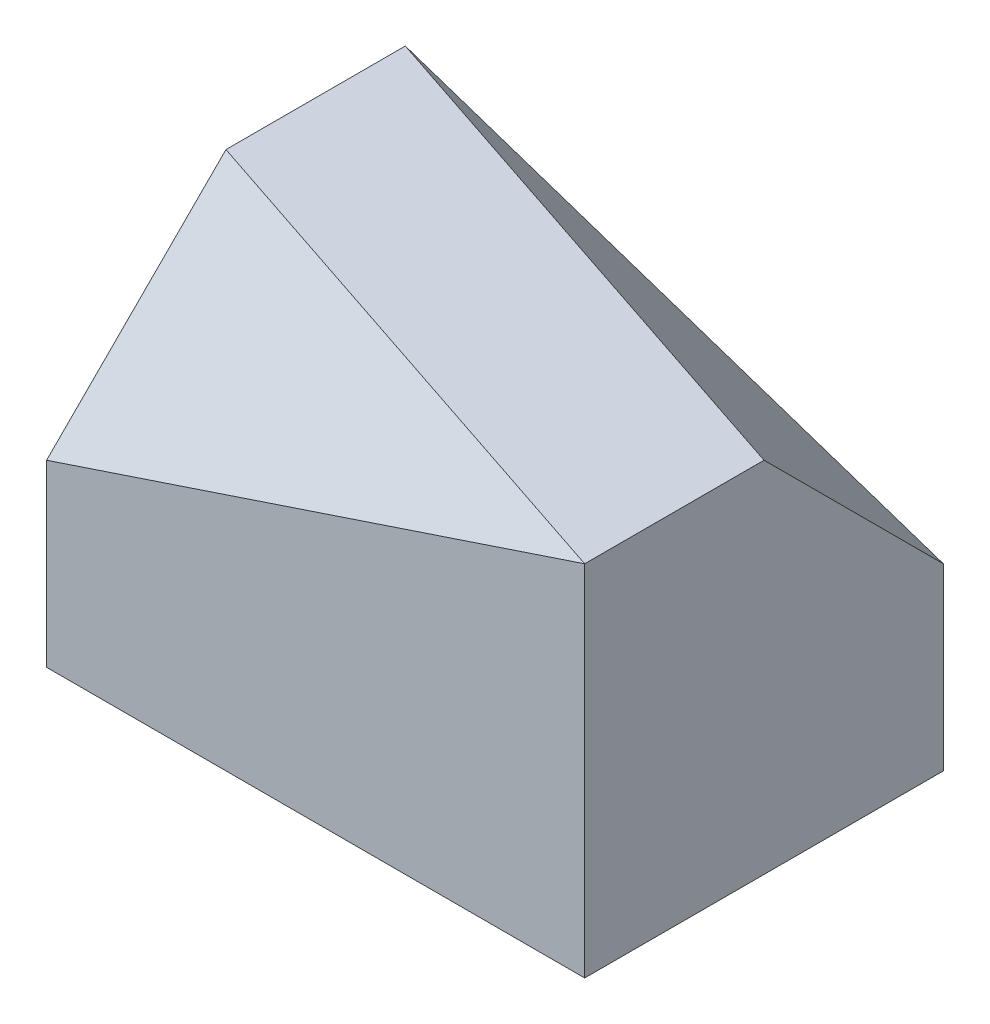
ISO-10303-21;
HEADER;
FILE_DESCRIPTION(('STEP AP214'),'2;1');
FILE_NAME('part.step','',(''),(''),'','','');
FILE_SCHEMA(('AUTOMOTIVE_DESIGN { 1 0 10303 214 1 1 1 1 }'));
ENDSEC;
DATA;
#1=APPLICATION_CONTEXT('core data for automotive mechanical design processes');
#2=APPLICATION_PROTOCOL_DEFINITION('international standard','automotive_design',2000,#1);
#3=PRODUCT_CONTEXT('',#1,'mechanical');
#4=PRODUCT('Part','Part','',(#3));
#5=PRODUCT_RELATED_PRODUCT_CATEGORY('part','',(#4));
#6=PRODUCT_DEFINITION_FORMATION('','',#4);
#7=PRODUCT_DEFINITION_CONTEXT('part definition',#1,'design');
#8=PRODUCT_DEFINITION('design','',#6,#7);
#9=PRODUCT_DEFINITION_SHAPE('','',#8);
#10=(LENGTH_UNIT() NAMED_UNIT(*) SI_UNIT(.MILLI.,.METRE.));
#11=(NAMED_UNIT(*) PLANE_ANGLE_UNIT() SI_UNIT($,.RADIAN.));
#12=(NAMED_UNIT(*) SI_UNIT($,.STERADIAN.) SOLID_ANGLE_UNIT());
#13=UNCERTAINTY_MEASURE_WITH_UNIT(LENGTH_MEASURE(1.E-05),#10,'distance_accuracy_value','');
#14=(GEOMETRIC_REPRESENTATION_CONTEXT(3) GLOBAL_UNCERTAINTY_ASSIGNED_CONTEXT((#13)) GLOBAL_UNIT_ASSIGNED_CONTEXT((#10,
#11,#12)) REPRESENTATION_CONTEXT('',''));
#15=CARTESIAN_POINT('',(0.,0.,0.));
#16=DIRECTION('',(0.,0.,1.));
#17=DIRECTION('',(1.,0.,0.));
#18=AXIS2_PLACEMENT_3D('',#15,#16,#17);
#19=CARTESIAN_POINT('',(0.,40.,-40.));
#20=DIRECTION('',(0.,-1.,0.));
#21=DIRECTION('',(0.,0.,-1.));
#22=AXIS2_PLACEMENT_3D('',#19,#20,#21);
#23=PLANE('',#22);
#24=DIRECTION('',(0.948683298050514,0.,0.316227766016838));
#25=VECTOR('',#24,1.);
#26=CARTESIAN_POINT('',(0.,40.,-40.));
#27=LINE('',#26,#25);
#28=CARTESIAN_POINT('',(0.,40.,-40.));
#29=VERTEX_POINT('',#28);
#30=CARTESIAN_POINT('',(60.,40.,-20.));
#31=VERTEX_POINT('',#30);
#32=EDGE_CURVE('E94',#29,#31,#27,.T.);
#33=ORIENTED_EDGE('',*,*,#32,.F.);
#34=DIRECTION('',(0.,0.,1.));
#35=VECTOR('',#34,1.);
#36=CARTESIAN_POINT('',(0.,40.,0.));
#37=LINE('',#36,#35);
#38=CARTESIAN_POINT('',(0.,40.,-20.));
#39=VERTEX_POINT('',#38);
#40=EDGE_CURVE('E77',#29,#39,#37,.T.);
#41=ORIENTED_EDGE('',*,*,#40,.T.);
#42=DIRECTION('',(0.948683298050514,0.,0.316227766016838));
#43=VECTOR('',#42,1.);
#44=CARTESIAN_POINT('',(-6.,40.,-22.));
#45=LINE('',#44,#43);
#46=CARTESIAN_POINT('',(60.,40.,0.));
#47=VERTEX_POINT('',#46);
#48=EDGE_CURVE('E96',#39,#47,#45,.T.);
#49=ORIENTED_EDGE('',*,*,#48,.T.);
#50=DIRECTION('',(0.,0.,-1.));
#51=VECTOR('',#50,1.);
#52=CARTESIAN_POINT('',(60.,40.,0.));
#53=LINE('',#52,#51);
#54=EDGE_CURVE('E86',#47,#31,#53,.T.);
#55=ORIENTED_EDGE('',*,*,#54,.T.);
#56=EDGE_LOOP('',(#33,#41,#49,#55));
#57=FACE_BOUND('',#56,.T.);
#58=ADVANCED_FACE('F30',(#57),#23,.F.);
#59=CARTESIAN_POINT('',(0.,40.,0.));
#60=DIRECTION('',(0.,0.,-1.));
#61=DIRECTION('',(-1.,0.,0.));
#62=AXIS2_PLACEMENT_3D('',#59,#60,#61);
#63=PLANE('',#62);
#64=DIRECTION('',(0.,-1.,0.));
#65=VECTOR('',#64,1.);
#66=CARTESIAN_POINT('',(60.,40.,0.));
#67=LINE('',#66,#65);
#68=CARTESIAN_POINT('',(60.,0.,0.));
#69=VERTEX_POINT('',#68);
#70=EDGE_CURVE('E107',#47,#69,#67,.T.);
#71=ORIENTED_EDGE('',*,*,#70,.F.);
#72=DIRECTION('',(-0.948683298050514,-0.316227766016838,0.));
#73=VECTOR('',#72,1.);
#74=CARTESIAN_POINT('',(6.,22.,0.));
#75=LINE('',#74,#73);
#76=CARTESIAN_POINT('',(0.,20.,0.));
#77=VERTEX_POINT('',#76);
#78=EDGE_CURVE('E101',#47,#77,#75,.T.);
#79=ORIENTED_EDGE('',*,*,#78,.T.);
#80=DIRECTION('',(0.,-1.,0.));
#81=VECTOR('',#80,1.);
#82=CARTESIAN_POINT('',(0.,40.,0.));
#83=LINE('',#82,#81);
#84=CARTESIAN_POINT('',(0.,0.,0.));
#85=VERTEX_POINT('',#84);
#86=EDGE_CURVE('E105',#77,#85,#83,.T.);
#87=ORIENTED_EDGE('',*,*,#86,.T.);
#88=DIRECTION('',(1.,0.,0.));
#89=VECTOR('',#88,1.);
#90=CARTESIAN_POINT('',(0.,0.,0.));
#91=LINE('',#90,#89);
#92=EDGE_CURVE('E115',#85,#69,#91,.T.);
#93=ORIENTED_EDGE('',*,*,#92,.T.);
#94=EDGE_LOOP('',(#71,#79,#87,#93));
#95=FACE_BOUND('',#94,.T.);
#96=ADVANCED_FACE('F125',(#95),#63,.F.);
#97=CARTESIAN_POINT('',(0.,40.,0.));
#98=DIRECTION('',(1.,0.,0.));
#99=DIRECTION('',(0.,0.,-1.));
#100=AXIS2_PLACEMENT_3D('',#97,#98,#99);
#101=PLANE('',#100);
#102=ORIENTED_EDGE('',*,*,#86,.F.);
#103=DIRECTION('',(0.,0.707106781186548,-0.707106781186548));
#104=VECTOR('',#103,1.);
#105=CARTESIAN_POINT('',(0.,30.,-10.));
#106=LINE('',#105,#104);
#107=EDGE_CURVE('E82',#77,#39,#106,.T.);
#108=ORIENTED_EDGE('',*,*,#107,.T.);
#109=ORIENTED_EDGE('',*,*,#40,.F.);
#110=DIRECTION('',(0.,-1.,0.));
#111=VECTOR('',#110,1.);
#112=CARTESIAN_POINT('',(0.,40.,-40.));
#113=LINE('',#112,#111);
#114=CARTESIAN_POINT('',(0.,0.,-40.));
#115=VERTEX_POINT('',#114);
#116=EDGE_CURVE('E80',#29,#115,#113,.T.);
#117=ORIENTED_EDGE('',*,*,#116,.T.);
#118=DIRECTION('',(0.,0.,1.));
#119=VECTOR('',#118,1.);
#120=CARTESIAN_POINT('',(0.,0.,0.));
#121=LINE('',#120,#119);
#122=EDGE_CURVE('E117',#115,#85,#121,.T.);
#123=ORIENTED_EDGE('',*,*,#122,.T.);
#124=EDGE_LOOP('',(#102,#108,#109,#117,#123));
#125=FACE_BOUND('',#124,.T.);
#126=ADVANCED_FACE('F32',(#125),#101,.F.);
#127=CARTESIAN_POINT('',(60.,40.,0.));
#128=DIRECTION('',(-1.,0.,0.));
#129=DIRECTION('',(0.,0.,1.));
#130=AXIS2_PLACEMENT_3D('',#127,#128,#129);
#131=PLANE('',#130);
#132=DIRECTION('',(0.,-0.707106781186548,-0.707106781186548));
#133=VECTOR('',#132,1.);
#134=CARTESIAN_POINT('',(60.,50.,-10.));
#135=LINE('',#134,#133);
#136=CARTESIAN_POINT('',(60.,20.,-40.));
#137=VERTEX_POINT('',#136);
#138=EDGE_CURVE('E38',#31,#137,#135,.T.);
#139=ORIENTED_EDGE('',*,*,#138,.F.);
#140=ORIENTED_EDGE('',*,*,#54,.F.);
#141=ORIENTED_EDGE('',*,*,#70,.T.);
#142=DIRECTION('',(0.,0.,-1.));
#143=VECTOR('',#142,1.);
#144=CARTESIAN_POINT('',(60.,0.,0.));
#145=LINE('',#144,#143);
#146=CARTESIAN_POINT('',(60.,0.,-40.));
#147=VERTEX_POINT('',#146);
#148=EDGE_CURVE('E112',#69,#147,#145,.T.);
#149=ORIENTED_EDGE('',*,*,#148,.T.);
#150=DIRECTION('',(0.,-1.,0.));
#151=VECTOR('',#150,1.);
#152=CARTESIAN_POINT('',(60.,40.,-40.));
#153=LINE('',#152,#151);
#154=EDGE_CURVE('E91',#137,#147,#153,.T.);
#155=ORIENTED_EDGE('',*,*,#154,.F.);
#156=EDGE_LOOP('',(#139,#140,#141,#149,#155));
#157=FACE_BOUND('',#156,.T.);
#158=ADVANCED_FACE('F126',(#157),#131,.F.);
#159=CARTESIAN_POINT('',(0.,40.,-40.));
#160=DIRECTION('',(0.,0.,1.));
#161=DIRECTION('',(1.,0.,0.));
#162=AXIS2_PLACEMENT_3D('',#159,#160,#161);
#163=PLANE('',#162);
#164=DIRECTION('',(-0.948683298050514,0.316227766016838,0.));
#165=VECTOR('',#164,1.);
#166=CARTESIAN_POINT('',(0.,40.,-40.));
#167=LINE('',#166,#165);
#168=EDGE_CURVE('E11',#137,#29,#167,.T.);
#169=ORIENTED_EDGE('',*,*,#168,.F.);
#170=ORIENTED_EDGE('',*,*,#154,.T.);
#171=DIRECTION('',(-1.,0.,0.));
#172=VECTOR('',#171,1.);
#173=CARTESIAN_POINT('',(0.,0.,-40.));
#174=LINE('',#173,#172);
#175=EDGE_CURVE('E87',#147,#115,#174,.T.);
#176=ORIENTED_EDGE('',*,*,#175,.T.);
#177=ORIENTED_EDGE('',*,*,#116,.F.);
#178=EDGE_LOOP('',(#169,#170,#176,#177));
#179=FACE_BOUND('',#178,.T.);
#180=ADVANCED_FACE('F89',(#179),#163,.F.);
#181=CARTESIAN_POINT('',(0.,0.,-40.));
#182=DIRECTION('',(0.,-1.,0.));
#183=DIRECTION('',(0.,0.,-1.));
#184=AXIS2_PLACEMENT_3D('',#181,#182,#183);
#185=PLANE('',#184);
#186=ORIENTED_EDGE('',*,*,#122,.F.);
#187=ORIENTED_EDGE('',*,*,#175,.F.);
#188=ORIENTED_EDGE('',*,*,#148,.F.);
#189=ORIENTED_EDGE('',*,*,#92,.F.);
#190=EDGE_LOOP('',(#186,#187,#188,#189));
#191=FACE_BOUND('',#190,.T.);
#192=ADVANCED_FACE('F121',(#191),#185,.T.);
#193=CARTESIAN_POINT('',(-0.199999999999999,19.8666666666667,0.0666666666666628));
#194=DIRECTION('',(0.229415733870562,-0.688247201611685,-0.688247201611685));
#195=DIRECTION('',(0.,0.707106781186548,-0.707106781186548));
#196=AXIS2_PLACEMENT_3D('',#193,#194,#195);
#197=PLANE('',#196);
#198=ORIENTED_EDGE('',*,*,#107,.F.);
#199=ORIENTED_EDGE('',*,*,#78,.F.);
#200=ORIENTED_EDGE('',*,*,#48,.F.);
#201=EDGE_LOOP('',(#198,#199,#200));
#202=FACE_BOUND('',#201,.T.);
#203=ADVANCED_FACE('F141',(#202),#197,.F.);
#204=CARTESIAN_POINT('',(60.2,40.0666666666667,-19.8666666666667));
#205=DIRECTION('',(0.229415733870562,0.688247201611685,-0.688247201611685));
#206=DIRECTION('',(0.,0.707106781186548,0.707106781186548));
#207=AXIS2_PLACEMENT_3D('',#204,#205,#206);
#208=PLANE('',#207);
#209=ORIENTED_EDGE('',*,*,#168,.T.);
#210=ORIENTED_EDGE('',*,*,#32,.T.);
#211=ORIENTED_EDGE('',*,*,#138,.T.);
#212=EDGE_LOOP('',(#209,#210,#211));
#213=FACE_BOUND('',#212,.T.);
#214=ADVANCED_FACE('F98',(#213),#208,.T.);
#215=CLOSED_SHELL('',(#58,#96,#126,#158,#180,#192,#203,#214));
#216=MANIFOLD_SOLID_BREP('B2',#215);
#217=ADVANCED_BREP_SHAPE_REPRESENTATION('',(#18,#216),#14);
#218=SHAPE_DEFINITION_REPRESENTATION(#9,#217);
ENDSEC;
END-ISO-10303-21;
